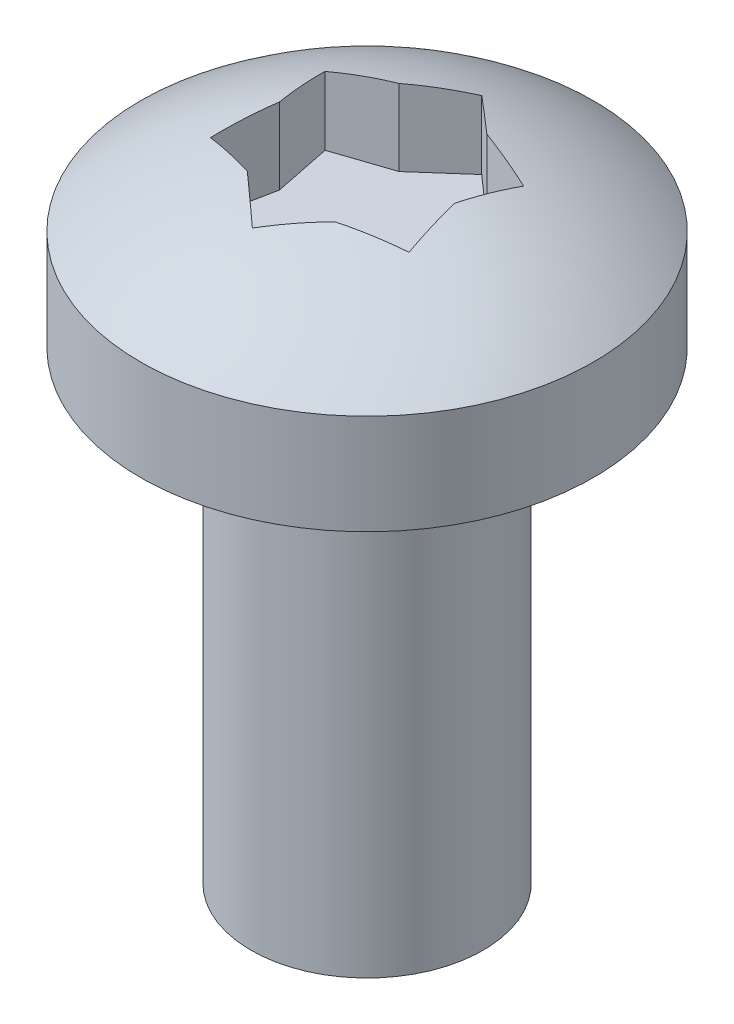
ISO-10303-21;
HEADER;
FILE_DESCRIPTION(('STEP AP214'),'2;1');
FILE_NAME('part.step','',(''),(''),'','','');
FILE_SCHEMA(('AUTOMOTIVE_DESIGN { 1 0 10303 214 1 1 1 1 }'));
ENDSEC;
DATA;
#1=APPLICATION_CONTEXT('core data for automotive mechanical design processes');
#2=APPLICATION_PROTOCOL_DEFINITION('international standard','automotive_design',2000,#1);
#3=PRODUCT_CONTEXT('',#1,'mechanical');
#4=PRODUCT('Part','Part','',(#3));
#5=PRODUCT_RELATED_PRODUCT_CATEGORY('part','',(#4));
#6=PRODUCT_DEFINITION_FORMATION('','',#4);
#7=PRODUCT_DEFINITION_CONTEXT('part definition',#1,'design');
#8=PRODUCT_DEFINITION('design','',#6,#7);
#9=PRODUCT_DEFINITION_SHAPE('','',#8);
#10=(LENGTH_UNIT() NAMED_UNIT(*) SI_UNIT(.MILLI.,.METRE.));
#11=(NAMED_UNIT(*) PLANE_ANGLE_UNIT() SI_UNIT($,.RADIAN.));
#12=(NAMED_UNIT(*) SI_UNIT($,.STERADIAN.) SOLID_ANGLE_UNIT());
#13=UNCERTAINTY_MEASURE_WITH_UNIT(LENGTH_MEASURE(1.E-05),#10,'distance_accuracy_value','');
#14=(GEOMETRIC_REPRESENTATION_CONTEXT(3) GLOBAL_UNCERTAINTY_ASSIGNED_CONTEXT((#13)) GLOBAL_UNIT_ASSIGNED_CONTEXT((#10,
#11,#12)) REPRESENTATION_CONTEXT('',''));
#15=CARTESIAN_POINT('',(0.,0.,0.));
#16=DIRECTION('',(0.,0.,1.));
#17=DIRECTION('',(1.,0.,0.));
#18=AXIS2_PLACEMENT_3D('',#15,#16,#17);
#19=CARTESIAN_POINT('',(1.7104001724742,9.58386739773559,0.987499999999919));
#20=DIRECTION('',(0.,1.,0.));
#21=DIRECTION('',(-1.,0.,0.));
#22=AXIS2_PLACEMENT_3D('',#19,#20,#21);
#23=PLANE('',#22);
#24=DIRECTION('',(0.948042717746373,0.,-0.318143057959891));
#25=VECTOR('',#24,1.);
#26=CARTESIAN_POINT('',(1.7104001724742,9.58386739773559,0.987499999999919));
#27=LINE('',#26,#25);
#28=CARTESIAN_POINT('',(0.755200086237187,9.58386739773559,1.30804491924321));
#29=VERTEX_POINT('',#28);
#30=CARTESIAN_POINT('',(1.71040017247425,9.58386739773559,0.98749999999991));
#31=VERTEX_POINT('',#30);
#32=EDGE_CURVE('E165',#29,#31,#27,.T.);
#33=ORIENTED_EDGE('',*,*,#32,.T.);
#34=DIRECTION('',(-0.198501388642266,0.,-0.980100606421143));
#35=VECTOR('',#34,1.);
#36=CARTESIAN_POINT('',(1.51040017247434,9.58386739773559,0.));
#37=LINE('',#36,#35);
#38=CARTESIAN_POINT('',(1.51040017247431,9.58386739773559,-1.16786338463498E-13));
#39=VERTEX_POINT('',#38);
#40=EDGE_CURVE('E170',#31,#39,#37,.T.);
#41=ORIENTED_EDGE('',*,*,#40,.T.);
#42=DIRECTION('',(0.19850138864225,0.,-0.980100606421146));
#43=VECTOR('',#42,1.);
#44=CARTESIAN_POINT('',(1.71040017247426,9.58386739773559,-0.98750000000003));
#45=LINE('',#44,#43);
#46=CARTESIAN_POINT('',(1.71040017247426,9.58386739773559,-0.987500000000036));
#47=VERTEX_POINT('',#46);
#48=EDGE_CURVE('E175',#39,#47,#45,.T.);
#49=ORIENTED_EDGE('',*,*,#48,.T.);
#50=DIRECTION('',(-0.948042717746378,0.,-0.318143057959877));
#51=VECTOR('',#50,1.);
#52=CARTESIAN_POINT('',(0.755200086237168,9.58386739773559,-1.30804491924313));
#53=LINE('',#52,#51);
#54=CARTESIAN_POINT('',(0.755200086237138,9.58386739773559,-1.30804491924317));
#55=VERTEX_POINT('',#54);
#56=EDGE_CURVE('E179',#47,#55,#53,.T.);
#57=ORIENTED_EDGE('',*,*,#56,.T.);
#58=DIRECTION('',(-0.749541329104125,0.,-0.661957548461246));
#59=VECTOR('',#58,1.);
#60=CARTESIAN_POINT('',(1.11022302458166E-13,9.58386739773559,-1.97500000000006));
#61=LINE('',#60,#59);
#62=CARTESIAN_POINT('',(0.,9.58386739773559,-1.97500000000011));
#63=VERTEX_POINT('',#62);
#64=EDGE_CURVE('E189',#55,#63,#61,.T.);
#65=ORIENTED_EDGE('',*,*,#64,.T.);
#66=DIRECTION('',(-0.749541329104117,0.,0.661957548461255));
#67=VECTOR('',#66,1.);
#68=CARTESIAN_POINT('',(-0.755200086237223,9.58386739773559,-1.30804491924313));
#69=LINE('',#68,#67);
#70=CARTESIAN_POINT('',(-0.755200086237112,9.58386739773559,-1.3080449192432));
#71=VERTEX_POINT('',#70);
#72=EDGE_CURVE('E93',#63,#71,#69,.T.);
#73=ORIENTED_EDGE('',*,*,#72,.T.);
#74=DIRECTION('',(-0.948042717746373,0.,0.318143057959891));
#75=VECTOR('',#74,1.);
#76=CARTESIAN_POINT('',(-1.71040017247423,9.58386739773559,-0.98750000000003));
#77=LINE('',#76,#75);
#78=CARTESIAN_POINT('',(-1.71040017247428,9.58386739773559,-0.98750000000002));
#79=VERTEX_POINT('',#78);
#80=EDGE_CURVE('E135',#71,#79,#77,.T.);
#81=ORIENTED_EDGE('',*,*,#80,.T.);
#82=DIRECTION('',(0.198501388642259,0.,0.980100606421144));
#83=VECTOR('',#82,1.);
#84=CARTESIAN_POINT('',(-1.51040017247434,9.58386739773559,2.22044604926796E-13));
#85=LINE('',#84,#83);
#86=CARTESIAN_POINT('',(-1.51040017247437,9.58386739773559,2.10207135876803E-13));
#87=VERTEX_POINT('',#86);
#88=EDGE_CURVE('E140',#79,#87,#85,.T.);
#89=ORIENTED_EDGE('',*,*,#88,.T.);
#90=DIRECTION('',(-0.198501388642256,0.,0.980100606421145));
#91=VECTOR('',#90,1.);
#92=CARTESIAN_POINT('',(-1.7104001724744,9.58386739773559,0.98750000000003));
#93=LINE('',#92,#91);
#94=CARTESIAN_POINT('',(-1.7104001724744,9.58386739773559,0.987500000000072));
#95=VERTEX_POINT('',#94);
#96=EDGE_CURVE('E145',#87,#95,#93,.T.);
#97=ORIENTED_EDGE('',*,*,#96,.T.);
#98=DIRECTION('',(0.948042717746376,0.,0.318143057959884));
#99=VECTOR('',#98,1.);
#100=CARTESIAN_POINT('',(-0.755200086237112,9.58386739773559,1.30804491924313));
#101=LINE('',#100,#99);
#102=CARTESIAN_POINT('',(-0.755200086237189,9.58386739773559,1.30804491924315));
#103=VERTEX_POINT('',#102);
#104=EDGE_CURVE('E150',#95,#103,#101,.T.);
#105=ORIENTED_EDGE('',*,*,#104,.T.);
#106=DIRECTION('',(0.74954132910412,0.,0.661957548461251));
#107=VECTOR('',#106,1.);
#108=CARTESIAN_POINT('',(0.,9.58386739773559,1.97500000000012));
#109=LINE('',#108,#107);
#110=CARTESIAN_POINT('',(0.,9.58386739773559,1.97500000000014));
#111=VERTEX_POINT('',#110);
#112=EDGE_CURVE('E155',#103,#111,#109,.T.);
#113=ORIENTED_EDGE('',*,*,#112,.T.);
#114=DIRECTION('',(0.749541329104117,0.,-0.661957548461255));
#115=VECTOR('',#114,1.);
#116=CARTESIAN_POINT('',(0.755200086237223,9.58386739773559,1.3080449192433));
#117=LINE('',#116,#115);
#118=EDGE_CURVE('E160',#111,#29,#117,.T.);
#119=ORIENTED_EDGE('',*,*,#118,.T.);
#120=EDGE_LOOP('',(#33,#41,#49,#57,#65,#73,#81,#89,#97,#105,#113,#119));
#121=FACE_BOUND('',#120,.T.);
#122=ADVANCED_FACE('F16',(#121),#23,.T.);
#123=CARTESIAN_POINT('',(1.11022302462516E-13,11.1724824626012,-1.97500000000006));
#124=DIRECTION('',(0.661957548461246,0.,-0.749541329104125));
#125=DIRECTION('',(-0.749541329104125,0.,-0.661957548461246));
#126=AXIS2_PLACEMENT_3D('',#123,#124,#125);
#127=PLANE('',#126);
#128=DIRECTION('',(0.,1.,0.));
#129=VECTOR('',#128,1.);
#130=CARTESIAN_POINT('',(0.,11.102,-1.97500000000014));
#131=LINE('',#130,#129);
#132=CARTESIAN_POINT('',(0.,10.7603467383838,-1.97500000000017));
#133=VERTEX_POINT('',#132);
#134=EDGE_CURVE('E79',#133,#63,#131,.F.);
#135=ORIENTED_EDGE('',*,*,#134,.T.);
#136=ORIENTED_EDGE('',*,*,#64,.F.);
#137=DIRECTION('',(0.,1.,0.));
#138=VECTOR('',#137,1.);
#139=CARTESIAN_POINT('',(0.755200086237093,11.1724824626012,-1.30804491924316));
#140=LINE('',#139,#138);
#141=CARTESIAN_POINT('',(0.755200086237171,10.8978772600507,-1.30804491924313));
#142=VERTEX_POINT('',#141);
#143=EDGE_CURVE('E82',#55,#142,#140,.T.);
#144=ORIENTED_EDGE('',*,*,#143,.T.);
#145=CARTESIAN_POINT('',(8.75662544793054E-13,10.7603467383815,-1.97499999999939));
#146=CARTESIAN_POINT('',(0.0414316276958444,10.7726790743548,-1.93840965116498));
#147=CARTESIAN_POINT('',(0.0829912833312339,10.7842470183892,-1.90170623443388));
#148=CARTESIAN_POINT('',(0.166270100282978,10.8058200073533,-1.8281585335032));
#149=CARTESIAN_POINT('',(0.207988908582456,10.8158274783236,-1.79131456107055));
#150=CARTESIAN_POINT('',(0.291586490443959,10.8342768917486,-1.71748534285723));
#151=CARTESIAN_POINT('',(0.333465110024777,10.8427200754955,-1.6805002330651));
#152=CARTESIAN_POINT('',(0.417384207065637,10.8580339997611,-1.60638706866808));
#153=CARTESIAN_POINT('',(0.459424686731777,10.8649047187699,-1.56925901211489));
#154=CARTESIAN_POINT('',(0.54366757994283,10.8770620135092,-1.49485988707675));
#155=CARTESIAN_POINT('',(0.585870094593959,10.8823473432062,-1.45758872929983));
#156=CARTESIAN_POINT('',(0.670437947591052,10.891319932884,-1.38290261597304));
#157=CARTESIAN_POINT('',(0.712803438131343,10.895004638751,-1.34548752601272));
#158=CARTESIAN_POINT('',(0.755200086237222,10.8978772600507,-1.3080449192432));
#159=B_SPLINE_CURVE_WITH_KNOTS('',3,(#145,#146,#147,#148,#149,#150,#151,#152,#153,#154,#155,
#156,#157,#158),.UNSPECIFIED.,.F.,.F.,(4,2,2,2,2,2,4),(0.,0.169899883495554,0.339532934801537,
0.509030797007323,0.678530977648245,0.848164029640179,1.01806677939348),.UNSPECIFIED.);
#160=EDGE_CURVE('E19',#133,#142,#159,.T.);
#161=ORIENTED_EDGE('',*,*,#160,.F.);
#162=EDGE_LOOP('',(#135,#136,#144,#161));
#163=FACE_BOUND('',#162,.T.);
#164=ADVANCED_FACE('F76',(#163),#127,.F.);
#165=CARTESIAN_POINT('',(0.755200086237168,11.1724824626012,-1.30804491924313));
#166=DIRECTION('',(0.318143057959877,0.,-0.948042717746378));
#167=DIRECTION('',(-0.948042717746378,0.,-0.318143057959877));
#168=AXIS2_PLACEMENT_3D('',#165,#166,#167);
#169=PLANE('',#168);
#170=ORIENTED_EDGE('',*,*,#143,.F.);
#171=ORIENTED_EDGE('',*,*,#56,.F.);
#172=DIRECTION('',(0.,1.,0.));
#173=VECTOR('',#172,1.);
#174=CARTESIAN_POINT('',(1.71040017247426,11.1724824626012,-0.98750000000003));
#175=LINE('',#174,#173);
#176=CARTESIAN_POINT('',(1.71040017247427,10.7603467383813,-0.987500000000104));
#177=VERTEX_POINT('',#176);
#178=EDGE_CURVE('E173',#47,#177,#175,.T.);
#179=ORIENTED_EDGE('',*,*,#178,.T.);
#180=CARTESIAN_POINT('',(0.755200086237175,10.8978772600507,-1.30804491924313));
#181=CARTESIAN_POINT('',(0.808824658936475,10.895004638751,-1.29004964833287));
#182=CARTESIAN_POINT('',(0.862409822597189,10.8913199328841,-1.27206760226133));
#183=CARTESIAN_POINT('',(0.969373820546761,10.8823473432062,-1.23617274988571));
#184=CARTESIAN_POINT('',(1.02275284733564,10.8770620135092,-1.21825987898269));
#185=CARTESIAN_POINT('',(1.12930582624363,10.8649047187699,-1.18250295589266));
#186=CARTESIAN_POINT('',(1.18247990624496,10.858033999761,-1.16465886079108));
#187=CARTESIAN_POINT('',(1.28862333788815,10.8427200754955,-1.12903937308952));
#188=CARTESIAN_POINT('',(1.34159269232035,10.8342768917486,-1.11126397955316));
#189=CARTESIAN_POINT('',(1.44732946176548,10.8158274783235,-1.07578095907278));
#190=CARTESIAN_POINT('',(1.50009668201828,10.8058200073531,-1.05807339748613));
#191=CARTESIAN_POINT('',(1.60543026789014,10.7842470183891,-1.02272567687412));
#192=CARTESIAN_POINT('',(1.65799618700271,10.7726790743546,-1.00508566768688));
#193=CARTESIAN_POINT('',(1.71040017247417,10.7603467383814,-0.987500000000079));
#194=B_SPLINE_CURVE_WITH_KNOTS('',3,(#180,#181,#182,#183,#184,#185,#186,#187,#188,#189,#190,
#191,#192,#193),.UNSPECIFIED.,.F.,.F.,(4,2,2,2,2,2,4),(0.,0.169902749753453,0.339535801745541,
0.509035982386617,0.678533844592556,0.848166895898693,1.0180667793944),.UNSPECIFIED.);
#195=EDGE_CURVE('E87',#142,#177,#194,.T.);
#196=ORIENTED_EDGE('',*,*,#195,.F.);
#197=EDGE_LOOP('',(#170,#171,#179,#196));
#198=FACE_BOUND('',#197,.T.);
#199=ADVANCED_FACE('F372',(#198),#169,.F.);
#200=CARTESIAN_POINT('',(1.71040017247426,11.1724824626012,-0.98750000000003));
#201=DIRECTION('',(0.980100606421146,0.,0.19850138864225));
#202=DIRECTION('',(0.19850138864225,0.,-0.980100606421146));
#203=AXIS2_PLACEMENT_3D('',#200,#201,#202);
#204=PLANE('',#203);
#205=ORIENTED_EDGE('',*,*,#178,.F.);
#206=ORIENTED_EDGE('',*,*,#48,.F.);
#207=DIRECTION('',(0.,1.,0.));
#208=VECTOR('',#207,1.);
#209=CARTESIAN_POINT('',(1.51040017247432,11.1724824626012,-1.14241274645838E-13));
#210=LINE('',#209,#208);
#211=CARTESIAN_POINT('',(1.51040017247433,10.8978772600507,0.));
#212=VERTEX_POINT('',#211);
#213=EDGE_CURVE('E168',#39,#212,#210,.T.);
#214=ORIENTED_EDGE('',*,*,#213,.T.);
#215=CARTESIAN_POINT('',(1.71040017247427,10.7603467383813,-0.987500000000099));
#216=CARTESIAN_POINT('',(1.69942781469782,10.7726790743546,-0.933323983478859));
#217=CARTESIAN_POINT('',(1.68842155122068,10.784247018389,-0.878980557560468));
#218=CARTESIAN_POINT('',(1.66636678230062,10.8058200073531,-0.770085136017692));
#219=CARTESIAN_POINT('',(1.65531837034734,10.8158274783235,-0.715533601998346));
#220=CARTESIAN_POINT('',(1.63317918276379,10.8342768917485,-0.60622136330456));
#221=CARTESIAN_POINT('',(1.62208844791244,10.8427200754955,-0.55146085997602));
#222=CARTESIAN_POINT('',(1.59986411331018,10.858033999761,-0.44172820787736));
#223=CARTESIAN_POINT('',(1.58873051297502,10.8649047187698,-0.386756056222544));
#224=CARTESIAN_POINT('',(1.56642042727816,10.8770620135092,-0.276600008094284));
#225=CARTESIAN_POINT('',(1.55524391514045,10.8823473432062,-0.221415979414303));
#226=CARTESIAN_POINT('',(1.53284777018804,10.8913199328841,-0.110835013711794));
#227=CARTESIAN_POINT('',(1.52162809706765,10.895004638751,-0.0554378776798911));
#228=CARTESIAN_POINT('',(1.51040017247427,10.8978772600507,0.));
#229=B_SPLINE_CURVE_WITH_KNOTS('',3,(#215,#216,#217,#218,#219,#220,#221,#222,#223,#224,#225,
#226,#227,#228),.UNSPECIFIED.,.F.,.F.,(4,2,2,2,2,2,4),(0.,0.16989988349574,0.339532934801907,
0.509030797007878,0.678530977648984,0.848164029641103,1.01806677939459),.UNSPECIFIED.);
#230=EDGE_CURVE('E426',#177,#212,#229,.T.);
#231=ORIENTED_EDGE('',*,*,#230,.F.);
#232=EDGE_LOOP('',(#205,#206,#214,#231));
#233=FACE_BOUND('',#232,.T.);
#234=ADVANCED_FACE('F362',(#233),#204,.F.);
#235=CARTESIAN_POINT('',(1.51040017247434,11.1724824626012,0.));
#236=DIRECTION('',(0.980100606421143,0.,-0.198501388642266));
#237=DIRECTION('',(-0.198501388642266,0.,-0.980100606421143));
#238=AXIS2_PLACEMENT_3D('',#235,#236,#237);
#239=PLANE('',#238);
#240=ORIENTED_EDGE('',*,*,#213,.F.);
#241=ORIENTED_EDGE('',*,*,#40,.F.);
#242=DIRECTION('',(0.,1.,0.));
#243=VECTOR('',#242,1.);
#244=CARTESIAN_POINT('',(1.7104001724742,11.1724824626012,0.987499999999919));
#245=LINE('',#244,#243);
#246=CARTESIAN_POINT('',(1.71040017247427,10.7603467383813,0.987499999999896));
#247=VERTEX_POINT('',#246);
#248=EDGE_CURVE('E163',#31,#247,#245,.T.);
#249=ORIENTED_EDGE('',*,*,#248,.T.);
#250=CARTESIAN_POINT('',(1.51040017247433,10.8978772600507,0.));
#251=CARTESIAN_POINT('',(1.52162809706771,10.895004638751,0.0554378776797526));
#252=CARTESIAN_POINT('',(1.5328477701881,10.891319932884,0.110835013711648));
#253=CARTESIAN_POINT('',(1.5552439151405,10.8823473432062,0.221415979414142));
#254=CARTESIAN_POINT('',(1.56642042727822,10.8770620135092,0.276600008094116));
#255=CARTESIAN_POINT('',(1.58873051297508,10.8649047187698,0.38675605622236));
#256=CARTESIAN_POINT('',(1.59986411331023,10.858033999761,0.441728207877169));
#257=CARTESIAN_POINT('',(1.62208844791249,10.8427200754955,0.551460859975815));
#258=CARTESIAN_POINT('',(1.63317918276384,10.8342768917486,0.606221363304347));
#259=CARTESIAN_POINT('',(1.65531837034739,10.8158274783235,0.715533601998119));
#260=CARTESIAN_POINT('',(1.66636678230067,10.8058200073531,0.770085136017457));
#261=CARTESIAN_POINT('',(1.68842155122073,10.7842470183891,0.878980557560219));
#262=CARTESIAN_POINT('',(1.69942781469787,10.7726790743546,0.933323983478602));
#263=CARTESIAN_POINT('',(1.71040017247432,10.7603467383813,0.987499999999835));
#264=B_SPLINE_CURVE_WITH_KNOTS('',3,(#250,#251,#252,#253,#254,#255,#256,#257,#258,#259,#260,
#261,#262,#263),.UNSPECIFIED.,.F.,.F.,(4,2,2,2,2,2,4),(0.,0.169902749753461,0.339535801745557,
0.50903598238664,0.678533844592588,0.848166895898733,1.01806677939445),.UNSPECIFIED.);
#265=EDGE_CURVE('E422',#212,#247,#264,.T.);
#266=ORIENTED_EDGE('',*,*,#265,.F.);
#267=EDGE_LOOP('',(#240,#241,#249,#266));
#268=FACE_BOUND('',#267,.T.);
#269=ADVANCED_FACE('F352',(#268),#239,.F.);
#270=CARTESIAN_POINT('',(1.7104001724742,11.1724824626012,0.987499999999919));
#271=DIRECTION('',(0.318143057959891,0.,0.948042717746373));
#272=DIRECTION('',(0.948042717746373,0.,-0.318143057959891));
#273=AXIS2_PLACEMENT_3D('',#270,#271,#272);
#274=PLANE('',#273);
#275=ORIENTED_EDGE('',*,*,#248,.F.);
#276=ORIENTED_EDGE('',*,*,#32,.F.);
#277=DIRECTION('',(0.,1.,0.));
#278=VECTOR('',#277,1.);
#279=CARTESIAN_POINT('',(0.75520008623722,11.1724824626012,1.3080449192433));
#280=LINE('',#279,#278);
#281=CARTESIAN_POINT('',(0.755200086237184,10.8978772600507,1.30804491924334));
#282=VERTEX_POINT('',#281);
#283=EDGE_CURVE('E158',#29,#282,#280,.T.);
#284=ORIENTED_EDGE('',*,*,#283,.T.);
#285=CARTESIAN_POINT('',(1.71040017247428,10.7603467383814,0.987499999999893));
#286=CARTESIAN_POINT('',(1.65799618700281,10.7726790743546,1.00508566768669));
#287=CARTESIAN_POINT('',(1.60543026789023,10.7842470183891,1.02272567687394));
#288=CARTESIAN_POINT('',(1.50009668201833,10.8058200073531,1.05807339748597));
#289=CARTESIAN_POINT('',(1.44732946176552,10.8158274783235,1.07578095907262));
#290=CARTESIAN_POINT('',(1.34159269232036,10.8342768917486,1.11126397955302));
#291=CARTESIAN_POINT('',(1.28862333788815,10.8427200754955,1.12903937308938));
#292=CARTESIAN_POINT('',(1.18247990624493,10.8580339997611,1.16465886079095));
#293=CARTESIAN_POINT('',(1.12930582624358,10.8649047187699,1.18250295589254));
#294=CARTESIAN_POINT('',(1.02275284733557,10.8770620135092,1.21825987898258));
#295=CARTESIAN_POINT('',(0.969373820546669,10.8823473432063,1.2361727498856));
#296=CARTESIAN_POINT('',(0.862409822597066,10.8913199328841,1.27206760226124));
#297=CARTESIAN_POINT('',(0.808824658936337,10.8950046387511,1.29004964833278));
#298=CARTESIAN_POINT('',(0.755200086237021,10.8978772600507,1.30804491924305));
#299=B_SPLINE_CURVE_WITH_KNOTS('',3,(#285,#286,#287,#288,#289,#290,#291,#292,#293,#294,#295,
#296,#297,#298),.UNSPECIFIED.,.F.,.F.,(4,2,2,2,2,2,4),(0.,0.169899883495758,0.339532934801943,
0.509030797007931,0.678530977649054,0.848164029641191,1.01806677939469),.UNSPECIFIED.);
#300=EDGE_CURVE('E417',#247,#282,#299,.T.);
#301=ORIENTED_EDGE('',*,*,#300,.F.);
#302=EDGE_LOOP('',(#275,#276,#284,#301));
#303=FACE_BOUND('',#302,.T.);
#304=ADVANCED_FACE('F342',(#303),#274,.F.);
#305=CARTESIAN_POINT('',(0.755200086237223,11.1724824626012,1.3080449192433));
#306=DIRECTION('',(0.661957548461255,0.,0.749541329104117));
#307=DIRECTION('',(0.749541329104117,0.,-0.661957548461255));
#308=AXIS2_PLACEMENT_3D('',#305,#306,#307);
#309=PLANE('',#308);
#310=ORIENTED_EDGE('',*,*,#283,.F.);
#311=ORIENTED_EDGE('',*,*,#118,.F.);
#312=DIRECTION('',(0.,1.,0.));
#313=VECTOR('',#312,1.);
#314=CARTESIAN_POINT('',(-1.10790447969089E-13,11.1724824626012,1.97500000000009));
#315=LINE('',#314,#313);
#316=CARTESIAN_POINT('',(0.,10.7603467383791,1.97500000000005));
#317=VERTEX_POINT('',#316);
#318=EDGE_CURVE('E153',#111,#317,#315,.T.);
#319=ORIENTED_EDGE('',*,*,#318,.T.);
#320=CARTESIAN_POINT('',(0.755200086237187,10.8978772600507,1.30804491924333));
#321=CARTESIAN_POINT('',(0.712803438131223,10.895004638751,1.34548752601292));
#322=CARTESIAN_POINT('',(0.67043794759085,10.891319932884,1.38290261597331));
#323=CARTESIAN_POINT('',(0.585870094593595,10.8823473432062,1.45758872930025));
#324=CARTESIAN_POINT('',(0.543667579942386,10.8770620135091,1.49485988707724));
#325=CARTESIAN_POINT('',(0.459424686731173,10.8649047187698,1.56925901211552));
#326=CARTESIAN_POINT('',(0.417384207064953,10.8580339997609,1.60638706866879));
#327=CARTESIAN_POINT('',(0.333465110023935,10.8427200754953,1.68050023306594));
#328=CARTESIAN_POINT('',(0.291586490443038,10.8342768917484,1.71748534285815));
#329=CARTESIAN_POINT('',(0.207988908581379,10.8158274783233,1.79131456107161));
#330=CARTESIAN_POINT('',(0.166270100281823,10.8058200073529,1.82815853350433));
#331=CARTESIAN_POINT('',(0.0829912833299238,10.7842470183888,1.90170623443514));
#332=CARTESIAN_POINT('',(0.0414316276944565,10.7726790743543,1.93840965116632));
#333=CARTESIAN_POINT('',(-5.90070329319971E-13,10.7603467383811,1.97500000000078));
#334=B_SPLINE_CURVE_WITH_KNOTS('',3,(#320,#321,#322,#323,#324,#325,#326,#327,#328,#329,#330,
#331,#332,#333),.UNSPECIFIED.,.F.,.F.,(4,2,2,2,2,2,4),(0.,0.169902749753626,0.339535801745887,
0.509035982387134,0.678533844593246,0.848166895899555,1.01806677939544),.UNSPECIFIED.);
#335=EDGE_CURVE('E421',#282,#317,#334,.T.);
#336=ORIENTED_EDGE('',*,*,#335,.F.);
#337=EDGE_LOOP('',(#310,#311,#319,#336));
#338=FACE_BOUND('',#337,.T.);
#339=ADVANCED_FACE('F332',(#338),#309,.F.);
#340=CARTESIAN_POINT('',(0.,11.1724824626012,1.97500000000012));
#341=DIRECTION('',(-0.661957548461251,0.,0.74954132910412));
#342=DIRECTION('',(0.74954132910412,0.,0.661957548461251));
#343=AXIS2_PLACEMENT_3D('',#340,#341,#342);
#344=PLANE('',#343);
#345=ORIENTED_EDGE('',*,*,#318,.F.);
#346=ORIENTED_EDGE('',*,*,#112,.F.);
#347=DIRECTION('',(0.,1.,0.));
#348=VECTOR('',#347,1.);
#349=CARTESIAN_POINT('',(-0.755200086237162,11.1724824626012,1.30804491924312));
#350=LINE('',#349,#348);
#351=CARTESIAN_POINT('',(-0.755200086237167,10.8978772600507,1.30804491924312));
#352=VERTEX_POINT('',#351);
#353=EDGE_CURVE('E148',#103,#352,#350,.T.);
#354=ORIENTED_EDGE('',*,*,#353,.T.);
#355=CARTESIAN_POINT('',(5.85319901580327E-13,10.7603467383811,1.9750000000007));
#356=CARTESIAN_POINT('',(-0.0414316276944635,10.7726790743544,1.93840965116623));
#357=CARTESIAN_POINT('',(-0.0829912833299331,10.7842470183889,1.90170623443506));
#358=CARTESIAN_POINT('',(-0.166270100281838,10.805820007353,1.82815853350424));
#359=CARTESIAN_POINT('',(-0.207988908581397,10.8158274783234,1.79131456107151));
#360=CARTESIAN_POINT('',(-0.291586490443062,10.8342768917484,1.71748534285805));
#361=CARTESIAN_POINT('',(-0.333465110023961,10.8427200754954,1.68050023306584));
#362=CARTESIAN_POINT('',(-0.417384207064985,10.858033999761,1.60638706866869));
#363=CARTESIAN_POINT('',(-0.459424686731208,10.8649047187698,1.56925901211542));
#364=CARTESIAN_POINT('',(-0.543667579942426,10.8770620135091,1.49485988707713));
#365=CARTESIAN_POINT('',(-0.585870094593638,10.8823473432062,1.45758872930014));
#366=CARTESIAN_POINT('',(-0.670437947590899,10.891319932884,1.3829026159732));
#367=CARTESIAN_POINT('',(-0.712803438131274,10.895004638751,1.3454875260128));
#368=CARTESIAN_POINT('',(-0.755200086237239,10.8978772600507,1.30804491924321));
#369=B_SPLINE_CURVE_WITH_KNOTS('',3,(#355,#356,#357,#358,#359,#360,#361,#362,#363,#364,#365,
#366,#367,#368),.UNSPECIFIED.,.F.,.F.,(4,2,2,2,2,2,4),(0.,0.169899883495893,0.339532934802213,
0.509030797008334,0.678530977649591,0.848164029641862,1.0180667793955),.UNSPECIFIED.);
#370=EDGE_CURVE('E471',#317,#352,#369,.T.);
#371=ORIENTED_EDGE('',*,*,#370,.F.);
#372=EDGE_LOOP('',(#345,#346,#354,#371));
#373=FACE_BOUND('',#372,.T.);
#374=ADVANCED_FACE('F322',(#373),#344,.F.);
#375=CARTESIAN_POINT('',(-0.755200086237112,11.1724824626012,1.30804491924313));
#376=DIRECTION('',(-0.318143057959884,0.,0.948042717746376));
#377=DIRECTION('',(0.948042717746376,0.,0.318143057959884));
#378=AXIS2_PLACEMENT_3D('',#375,#376,#377);
#379=PLANE('',#378);
#380=ORIENTED_EDGE('',*,*,#353,.F.);
#381=ORIENTED_EDGE('',*,*,#104,.F.);
#382=DIRECTION('',(0.,1.,0.));
#383=VECTOR('',#382,1.);
#384=CARTESIAN_POINT('',(-1.71040017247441,11.1724824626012,0.987500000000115));
#385=LINE('',#384,#383);
#386=CARTESIAN_POINT('',(-1.71040017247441,10.7603467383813,0.987500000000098));
#387=VERTEX_POINT('',#386);
#388=EDGE_CURVE('E143',#95,#387,#385,.T.);
#389=ORIENTED_EDGE('',*,*,#388,.T.);
#390=CARTESIAN_POINT('',(-0.755200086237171,10.8978772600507,1.30804491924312));
#391=CARTESIAN_POINT('',(-0.808824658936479,10.895004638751,1.29004964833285));
#392=CARTESIAN_POINT('',(-0.8624098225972,10.8913199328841,1.27206760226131));
#393=CARTESIAN_POINT('',(-0.969373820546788,10.8823473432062,1.23617274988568));
#394=CARTESIAN_POINT('',(-1.02275284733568,10.8770620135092,1.21825987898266));
#395=CARTESIAN_POINT('',(-1.12930582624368,10.8649047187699,1.18250295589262));
#396=CARTESIAN_POINT('',(-1.18247990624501,10.858033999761,1.16465886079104));
#397=CARTESIAN_POINT('',(-1.28862333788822,10.8427200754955,1.12903937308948));
#398=CARTESIAN_POINT('',(-1.34159269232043,10.8342768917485,1.11126397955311));
#399=CARTESIAN_POINT('',(-1.44732946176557,10.8158274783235,1.07578095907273));
#400=CARTESIAN_POINT('',(-1.50009668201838,10.8058200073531,1.05807339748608));
#401=CARTESIAN_POINT('',(-1.60543026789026,10.784247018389,1.02272567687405));
#402=CARTESIAN_POINT('',(-1.65799618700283,10.7726790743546,1.00508566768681));
#403=CARTESIAN_POINT('',(-1.7104001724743,10.7603467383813,0.987500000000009));
#404=B_SPLINE_CURVE_WITH_KNOTS('',3,(#390,#391,#392,#393,#394,#395,#396,#397,#398,#399,#400,
#401,#402,#403),.UNSPECIFIED.,.F.,.F.,(4,2,2,2,2,2,4),(0.,0.169902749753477,0.33953580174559,
0.50903598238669,0.678533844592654,0.848166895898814,1.01806677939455),.UNSPECIFIED.);
#405=EDGE_CURVE('E474',#352,#387,#404,.T.);
#406=ORIENTED_EDGE('',*,*,#405,.F.);
#407=EDGE_LOOP('',(#380,#381,#389,#406));
#408=FACE_BOUND('',#407,.T.);
#409=ADVANCED_FACE('F312',(#408),#379,.F.);
#410=CARTESIAN_POINT('',(-1.7104001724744,11.1724824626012,0.98750000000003));
#411=DIRECTION('',(-0.980100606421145,0.,-0.198501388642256));
#412=DIRECTION('',(-0.198501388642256,0.,0.980100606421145));
#413=AXIS2_PLACEMENT_3D('',#410,#411,#412);
#414=PLANE('',#413);
#415=ORIENTED_EDGE('',*,*,#388,.F.);
#416=ORIENTED_EDGE('',*,*,#96,.F.);
#417=DIRECTION('',(0.,1.,0.));
#418=VECTOR('',#417,1.);
#419=CARTESIAN_POINT('',(-1.51040017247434,11.1724824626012,2.16646558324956E-13));
#420=LINE('',#419,#418);
#421=CARTESIAN_POINT('',(-1.51040017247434,10.8978772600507,2.18634060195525E-13));
#422=VERTEX_POINT('',#421);
#423=EDGE_CURVE('E138',#87,#422,#420,.T.);
#424=ORIENTED_EDGE('',*,*,#423,.T.);
#425=CARTESIAN_POINT('',(-1.71040017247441,10.7603467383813,0.987500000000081));
#426=CARTESIAN_POINT('',(-1.69942781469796,10.7726790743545,0.933323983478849));
#427=CARTESIAN_POINT('',(-1.68842155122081,10.784247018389,0.878980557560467));
#428=CARTESIAN_POINT('',(-1.66636678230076,10.8058200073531,0.770085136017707));
#429=CARTESIAN_POINT('',(-1.65531837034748,10.8158274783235,0.71553360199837));
#430=CARTESIAN_POINT('',(-1.63317918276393,10.8342768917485,0.6062213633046));
#431=CARTESIAN_POINT('',(-1.62208844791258,10.8427200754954,0.551460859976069));
#432=CARTESIAN_POINT('',(-1.59986411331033,10.858033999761,0.441728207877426));
#433=CARTESIAN_POINT('',(-1.58873051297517,10.8649047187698,0.386756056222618));
#434=CARTESIAN_POINT('',(-1.56642042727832,10.8770620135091,0.276600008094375));
#435=CARTESIAN_POINT('',(-1.5552439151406,10.8823473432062,0.221415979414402));
#436=CARTESIAN_POINT('',(-1.5328477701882,10.891319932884,0.11083501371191));
#437=CARTESIAN_POINT('',(-1.52162809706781,10.895004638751,0.0554378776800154));
#438=CARTESIAN_POINT('',(-1.51040017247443,10.8978772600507,2.02702878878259E-13));
#439=B_SPLINE_CURVE_WITH_KNOTS('',3,(#425,#426,#427,#428,#429,#430,#431,#432,#433,#434,#435,
#436,#437,#438),.UNSPECIFIED.,.F.,.F.,(4,2,2,2,2,2,4),(0.,0.169899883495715,0.339532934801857,
0.509030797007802,0.678530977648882,0.848164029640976,1.01806677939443),.UNSPECIFIED.);
#440=EDGE_CURVE('E476',#387,#422,#439,.T.);
#441=ORIENTED_EDGE('',*,*,#440,.F.);
#442=EDGE_LOOP('',(#415,#416,#424,#441));
#443=FACE_BOUND('',#442,.T.);
#444=ADVANCED_FACE('F302',(#443),#414,.F.);
#445=CARTESIAN_POINT('',(-1.51040017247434,11.1724824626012,2.22044604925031E-13));
#446=DIRECTION('',(-0.980100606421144,0.,0.198501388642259));
#447=DIRECTION('',(0.198501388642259,0.,0.980100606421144));
#448=AXIS2_PLACEMENT_3D('',#445,#446,#447);
#449=PLANE('',#448);
#450=ORIENTED_EDGE('',*,*,#423,.F.);
#451=ORIENTED_EDGE('',*,*,#88,.F.);
#452=DIRECTION('',(0.,1.,0.));
#453=VECTOR('',#452,1.);
#454=CARTESIAN_POINT('',(-1.71040017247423,11.102,-0.98750000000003));
#455=LINE('',#454,#453);
#456=CARTESIAN_POINT('',(-1.71040017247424,10.7603467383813,-0.987500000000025));
#457=VERTEX_POINT('',#456);
#458=EDGE_CURVE('E94',#79,#457,#455,.T.);
#459=ORIENTED_EDGE('',*,*,#458,.T.);
#460=CARTESIAN_POINT('',(-1.51040017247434,10.8978772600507,2.15223515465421E-13));
#461=CARTESIAN_POINT('',(-1.52162809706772,10.895004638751,-0.0554378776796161));
#462=CARTESIAN_POINT('',(-1.53284777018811,10.891319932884,-0.11083501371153));
#463=CARTESIAN_POINT('',(-1.55524391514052,10.8823473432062,-0.221415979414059));
#464=CARTESIAN_POINT('',(-1.56642042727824,10.8770620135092,-0.276600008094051));
#465=CARTESIAN_POINT('',(-1.58873051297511,10.8649047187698,-0.386756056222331));
#466=CARTESIAN_POINT('',(-1.59986411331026,10.858033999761,-0.441728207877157));
#467=CARTESIAN_POINT('',(-1.62208844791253,10.8427200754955,-0.551460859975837));
#468=CARTESIAN_POINT('',(-1.63317918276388,10.8342768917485,-0.606221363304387));
#469=CARTESIAN_POINT('',(-1.65531837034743,10.8158274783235,-0.715533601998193));
#470=CARTESIAN_POINT('',(-1.66636678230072,10.8058200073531,-0.770085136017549));
#471=CARTESIAN_POINT('',(-1.68842155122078,10.784247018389,-0.878980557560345));
#472=CARTESIAN_POINT('',(-1.69942781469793,10.7726790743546,-0.933323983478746));
#473=CARTESIAN_POINT('',(-1.71040017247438,10.7603467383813,-0.987499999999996));
#474=B_SPLINE_CURVE_WITH_KNOTS('',3,(#460,#461,#462,#463,#464,#465,#466,#467,#468,#469,#470,
#471,#472,#473),.UNSPECIFIED.,.F.,.F.,(4,2,2,2,2,2,4),(0.,0.169902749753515,0.339535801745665,
0.509035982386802,0.678533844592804,0.848166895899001,1.01806677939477),.UNSPECIFIED.);
#475=EDGE_CURVE('E104',#422,#457,#474,.T.);
#476=ORIENTED_EDGE('',*,*,#475,.F.);
#477=EDGE_LOOP('',(#450,#451,#459,#476));
#478=FACE_BOUND('',#477,.T.);
#479=ADVANCED_FACE('F294',(#478),#449,.F.);
#480=CARTESIAN_POINT('',(-1.71040017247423,11.102,-0.98750000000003));
#481=DIRECTION('',(-0.318143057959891,0.,-0.948042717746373));
#482=DIRECTION('',(-0.948042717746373,0.,0.318143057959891));
#483=AXIS2_PLACEMENT_3D('',#480,#481,#482);
#484=PLANE('',#483);
#485=ORIENTED_EDGE('',*,*,#458,.F.);
#486=ORIENTED_EDGE('',*,*,#80,.F.);
#487=DIRECTION('',(0.,1.,0.));
#488=VECTOR('',#487,1.);
#489=CARTESIAN_POINT('',(-0.755200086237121,11.102,-1.30804491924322));
#490=LINE('',#489,#488);
#491=CARTESIAN_POINT('',(-0.755200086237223,10.8978772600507,-1.30804491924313));
#492=VERTEX_POINT('',#491);
#493=EDGE_CURVE('E38',#71,#492,#490,.T.);
#494=ORIENTED_EDGE('',*,*,#493,.T.);
#495=CARTESIAN_POINT('',(-1.71040017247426,10.7603467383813,-0.98750000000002));
#496=CARTESIAN_POINT('',(-1.6579961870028,10.7726790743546,-1.00508566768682));
#497=CARTESIAN_POINT('',(-1.60543026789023,10.7842470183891,-1.02272567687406));
#498=CARTESIAN_POINT('',(-1.50009668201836,10.8058200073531,-1.05807339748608));
#499=CARTESIAN_POINT('',(-1.44732946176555,10.8158274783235,-1.07578095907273));
#500=CARTESIAN_POINT('',(-1.34159269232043,10.8342768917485,-1.11126397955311));
#501=CARTESIAN_POINT('',(-1.28862333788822,10.8427200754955,-1.12903937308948));
#502=CARTESIAN_POINT('',(-1.18247990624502,10.858033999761,-1.16465886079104));
#503=CARTESIAN_POINT('',(-1.12930582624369,10.8649047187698,-1.18250295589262));
#504=CARTESIAN_POINT('',(-1.0227528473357,10.8770620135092,-1.21825987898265));
#505=CARTESIAN_POINT('',(-0.969373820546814,10.8823473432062,-1.23617274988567));
#506=CARTESIAN_POINT('',(-0.862409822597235,10.8913199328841,-1.2720676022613));
#507=CARTESIAN_POINT('',(-0.808824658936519,10.895004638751,-1.29004964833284));
#508=CARTESIAN_POINT('',(-0.755200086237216,10.8978772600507,-1.3080449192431));
#509=B_SPLINE_CURVE_WITH_KNOTS('',3,(#495,#496,#497,#498,#499,#500,#501,#502,#503,#504,#505,
#506,#507,#508),.UNSPECIFIED.,.F.,.F.,(4,2,2,2,2,2,4),(0.,0.169899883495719,0.339532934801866,
0.509030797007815,0.678530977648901,0.848164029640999,1.01806677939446),.UNSPECIFIED.);
#510=EDGE_CURVE('E98',#457,#492,#509,.T.);
#511=ORIENTED_EDGE('',*,*,#510,.F.);
#512=EDGE_LOOP('',(#485,#486,#494,#511));
#513=FACE_BOUND('',#512,.T.);
#514=ADVANCED_FACE('F286',(#513),#484,.F.);
#515=CARTESIAN_POINT('',(-0.755200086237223,11.102,-1.30804491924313));
#516=DIRECTION('',(-0.661957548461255,0.,-0.749541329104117));
#517=DIRECTION('',(-0.749541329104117,0.,0.661957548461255));
#518=AXIS2_PLACEMENT_3D('',#515,#516,#517);
#519=PLANE('',#518);
#520=ORIENTED_EDGE('',*,*,#493,.F.);
#521=ORIENTED_EDGE('',*,*,#72,.F.);
#522=ORIENTED_EDGE('',*,*,#134,.F.);
#523=CARTESIAN_POINT('',(-0.755200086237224,10.8978772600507,-1.30804491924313));
#524=CARTESIAN_POINT('',(-0.712803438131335,10.895004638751,-1.34548752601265));
#525=CARTESIAN_POINT('',(-0.670437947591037,10.8913199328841,-1.38290261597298));
#526=CARTESIAN_POINT('',(-0.58587009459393,10.8823473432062,-1.45758872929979));
#527=CARTESIAN_POINT('',(-0.543667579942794,10.8770620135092,-1.49485988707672));
#528=CARTESIAN_POINT('',(-0.459424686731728,10.8649047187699,-1.56925901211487));
#529=CARTESIAN_POINT('',(-0.417384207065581,10.8580339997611,-1.60638706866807));
#530=CARTESIAN_POINT('',(-0.333465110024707,10.8427200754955,-1.68050023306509));
#531=CARTESIAN_POINT('',(-0.291586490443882,10.8342768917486,-1.71748534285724));
#532=CARTESIAN_POINT('',(-0.207988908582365,10.8158274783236,-1.79131456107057));
#533=CARTESIAN_POINT('',(-0.166270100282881,10.8058200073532,-1.82815853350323));
#534=CARTESIAN_POINT('',(-0.0829912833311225,10.7842470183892,-1.90170623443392));
#535=CARTESIAN_POINT('',(-0.0414316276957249,10.7726790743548,-1.93840965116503));
#536=CARTESIAN_POINT('',(-7.46125723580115E-13,10.7603467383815,-1.97499999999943));
#537=B_SPLINE_CURVE_WITH_KNOTS('',3,(#523,#524,#525,#526,#527,#528,#529,#530,#531,#532,#533,
#534,#535,#536),.UNSPECIFIED.,.F.,.F.,(4,2,2,2,2,2,4),(0.,0.169902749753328,0.339535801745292,
0.509035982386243,0.678533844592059,0.848166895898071,1.01806677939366),.UNSPECIFIED.);
#538=EDGE_CURVE('E90',#492,#133,#537,.T.);
#539=ORIENTED_EDGE('',*,*,#538,.F.);
#540=EDGE_LOOP('',(#520,#521,#522,#539));
#541=FACE_BOUND('',#540,.T.);
#542=ADVANCED_FACE('F89',(#541),#519,.F.);
#543=CARTESIAN_POINT('',(0.,4.60078481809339,-0.101005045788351));
#544=DIRECTION('',(1.,0.,0.));
#545=DIRECTION('',(0.,0.,1.));
#546=AXIS2_PLACEMENT_3D('',#543,#544,#545);
#547=CIRCLE('',#546,6.5);
#548=TRIMMED_CURVE('',#547,(PARAMETER_VALUE(-1.55525646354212)),
(PARAMETER_VALUE(1.55525646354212)),.T.,.PARAMETER.);
#549=CARTESIAN_POINT('',(0.,4.60078481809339,0.));
#550=DIRECTION('',(0.,1.,0.));
#551=AXIS1_PLACEMENT('',#549,#550);
#552=SURFACE_OF_REVOLUTION('',#548,#551);
#553=CARTESIAN_POINT('',(0.,9.7234753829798,0.));
#554=DIRECTION('',(0.,1.,0.));
#555=DIRECTION('',(-1.,0.,0.));
#556=AXIS2_PLACEMENT_3D('',#553,#554,#555);
#557=CIRCLE('',#556,3.90000000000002);
#558=CARTESIAN_POINT('',(-3.90000000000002,9.7234753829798,0.));
#559=VERTEX_POINT('',#558);
#560=EDGE_CURVE('E99',#559,#559,#557,.F.);
#561=ORIENTED_EDGE('',*,*,#560,.F.);
#562=EDGE_LOOP('',(#561));
#563=FACE_BOUND('',#562,.T.);
#564=ORIENTED_EDGE('',*,*,#510,.T.);
#565=ORIENTED_EDGE('',*,*,#538,.T.);
#566=ORIENTED_EDGE('',*,*,#160,.T.);
#567=ORIENTED_EDGE('',*,*,#195,.T.);
#568=ORIENTED_EDGE('',*,*,#230,.T.);
#569=ORIENTED_EDGE('',*,*,#265,.T.);
#570=ORIENTED_EDGE('',*,*,#300,.T.);
#571=ORIENTED_EDGE('',*,*,#335,.T.);
#572=ORIENTED_EDGE('',*,*,#370,.T.);
#573=ORIENTED_EDGE('',*,*,#405,.T.);
#574=ORIENTED_EDGE('',*,*,#440,.T.);
#575=ORIENTED_EDGE('',*,*,#475,.T.);
#576=EDGE_LOOP('',(#564,#565,#566,#567,#568,#569,#570,#571,#572,#573,#574,#575));
#577=FACE_BOUND('',#576,.T.);
#578=ADVANCED_FACE('F96',(#563,#577),#552,.F.);
#579=CARTESIAN_POINT('',(0.,0.,0.));
#580=DIRECTION('',(0.,1.,0.));
#581=DIRECTION('',(-1.,0.,0.));
#582=AXIS2_PLACEMENT_3D('',#579,#580,#581);
#583=CYLINDRICAL_SURFACE('',#582,3.90000000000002);
#584=CARTESIAN_POINT('',(0.,8.00000000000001,0.));
#585=DIRECTION('',(0.,1.,0.));
#586=DIRECTION('',(-1.,0.,0.));
#587=AXIS2_PLACEMENT_3D('',#584,#585,#586);
#588=CIRCLE('',#587,3.90000000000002);
#589=CARTESIAN_POINT('',(-3.90000000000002,8.00000000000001,0.));
#590=VERTEX_POINT('',#589);
#591=EDGE_CURVE('E102',#590,#590,#588,.F.);
#592=ORIENTED_EDGE('',*,*,#591,.F.);
#593=EDGE_LOOP('',(#592));
#594=FACE_BOUND('',#593,.T.);
#595=ORIENTED_EDGE('',*,*,#560,.T.);
#596=EDGE_LOOP('',(#595));
#597=FACE_BOUND('',#596,.T.);
#598=ADVANCED_FACE('F122',(#594,#597),#583,.T.);
#599=CARTESIAN_POINT('',(-2.0000000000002,0.,-2.22044604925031E-13));
#600=DIRECTION('',(0.,-1.,0.));
#601=DIRECTION('',(1.,0.,0.));
#602=AXIS2_PLACEMENT_3D('',#599,#600,#601);
#603=PLANE('',#602);
#604=CARTESIAN_POINT('',(0.,0.,0.));
#605=DIRECTION('',(0.,1.,0.));
#606=DIRECTION('',(-1.,0.,0.));
#607=AXIS2_PLACEMENT_3D('',#604,#605,#606);
#608=CIRCLE('',#607,2.00000000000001);
#609=CARTESIAN_POINT('',(-2.00000000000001,0.,0.));
#610=VERTEX_POINT('',#609);
#611=EDGE_CURVE('E29',#610,#610,#608,.T.);
#612=ORIENTED_EDGE('',*,*,#611,.F.);
#613=EDGE_LOOP('',(#612));
#614=FACE_BOUND('',#613,.T.);
#615=ADVANCED_FACE('F240',(#614),#603,.T.);
#616=CARTESIAN_POINT('',(-3.89999999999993,8.00000000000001,0.));
#617=DIRECTION('',(0.,-1.,0.));
#618=DIRECTION('',(1.,0.,0.));
#619=AXIS2_PLACEMENT_3D('',#616,#617,#618);
#620=PLANE('',#619);
#621=ORIENTED_EDGE('',*,*,#591,.T.);
#622=EDGE_LOOP('',(#621));
#623=FACE_BOUND('',#622,.T.);
#624=CARTESIAN_POINT('',(0.,8.00000000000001,0.));
#625=DIRECTION('',(0.,1.,0.));
#626=DIRECTION('',(-1.,0.,0.));
#627=AXIS2_PLACEMENT_3D('',#624,#625,#626);
#628=CIRCLE('',#627,2.00000000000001);
#629=CARTESIAN_POINT('',(-2.00000000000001,8.00000000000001,0.));
#630=VERTEX_POINT('',#629);
#631=EDGE_CURVE('E10',#630,#630,#628,.F.);
#632=ORIENTED_EDGE('',*,*,#631,.F.);
#633=EDGE_LOOP('',(#632));
#634=FACE_BOUND('',#633,.T.);
#635=ADVANCED_FACE('F235',(#623,#634),#620,.T.);
#636=CARTESIAN_POINT('',(0.,0.,0.));
#637=DIRECTION('',(0.,1.,0.));
#638=DIRECTION('',(-1.,0.,0.));
#639=AXIS2_PLACEMENT_3D('',#636,#637,#638);
#640=CYLINDRICAL_SURFACE('',#639,2.00000000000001);
#641=ORIENTED_EDGE('',*,*,#611,.T.);
#642=EDGE_LOOP('',(#641));
#643=FACE_BOUND('',#642,.T.);
#644=ORIENTED_EDGE('',*,*,#631,.T.);
#645=EDGE_LOOP('',(#644));
#646=FACE_BOUND('',#645,.T.);
#647=ADVANCED_FACE('F247',(#643,#646),#640,.T.);
#648=CLOSED_SHELL('',(#122,#164,#199,#234,#269,#304,#339,#374,#409,#444,#479,#514,#542,#578,
#598,#615,#635,#647));
#649=MANIFOLD_SOLID_BREP('B1',#648);
#650=ADVANCED_BREP_SHAPE_REPRESENTATION('',(#18,#649),#14);
#651=SHAPE_DEFINITION_REPRESENTATION(#9,#650);
ENDSEC;
END-ISO-10303-21;
